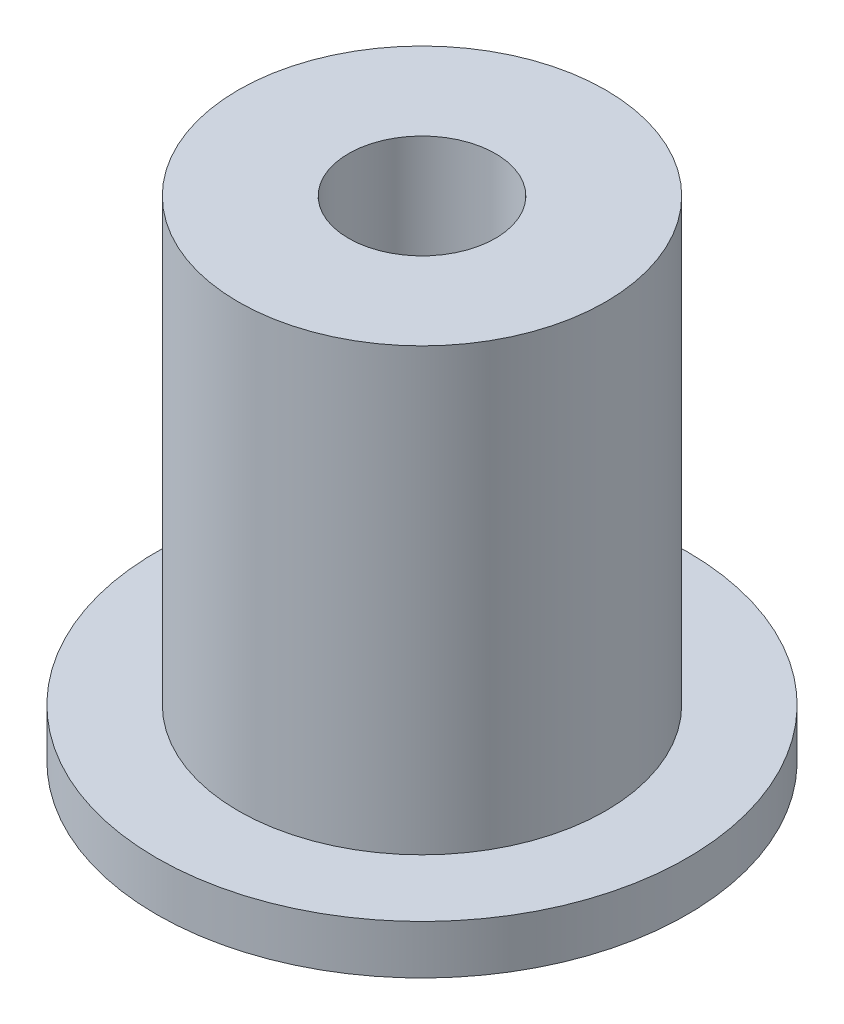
ISO-10303-21;
HEADER;
FILE_DESCRIPTION(('STEP AP214'),'2;1');
FILE_NAME('part.step','',(''),(''),'','','');
FILE_SCHEMA(('AUTOMOTIVE_DESIGN { 1 0 10303 214 1 1 1 1 }'));
ENDSEC;
DATA;
#1=APPLICATION_CONTEXT('core data for automotive mechanical design processes');
#2=APPLICATION_PROTOCOL_DEFINITION('international standard','automotive_design',2000,#1);
#3=PRODUCT_CONTEXT('',#1,'mechanical');
#4=PRODUCT('Part','Part','',(#3));
#5=PRODUCT_RELATED_PRODUCT_CATEGORY('part','',(#4));
#6=PRODUCT_DEFINITION_FORMATION('','',#4);
#7=PRODUCT_DEFINITION_CONTEXT('part definition',#1,'design');
#8=PRODUCT_DEFINITION('design','',#6,#7);
#9=PRODUCT_DEFINITION_SHAPE('','',#8);
#10=(LENGTH_UNIT() NAMED_UNIT(*) SI_UNIT(.MILLI.,.METRE.));
#11=(NAMED_UNIT(*) PLANE_ANGLE_UNIT() SI_UNIT($,.RADIAN.));
#12=(NAMED_UNIT(*) SI_UNIT($,.STERADIAN.) SOLID_ANGLE_UNIT());
#13=UNCERTAINTY_MEASURE_WITH_UNIT(LENGTH_MEASURE(1.E-05),#10,'distance_accuracy_value','');
#14=(GEOMETRIC_REPRESENTATION_CONTEXT(3) GLOBAL_UNCERTAINTY_ASSIGNED_CONTEXT((#13)) GLOBAL_UNIT_ASSIGNED_CONTEXT((#10,
#11,#12)) REPRESENTATION_CONTEXT('',''));
#15=CARTESIAN_POINT('',(0.,0.,0.));
#16=DIRECTION('',(0.,0.,1.));
#17=DIRECTION('',(1.,0.,0.));
#18=AXIS2_PLACEMENT_3D('',#15,#16,#17);
#19=CARTESIAN_POINT('',(0.,6.,0.));
#20=DIRECTION('',(0.,-1.,0.));
#21=DIRECTION('',(0.,0.,-1.));
#22=AXIS2_PLACEMENT_3D('',#19,#20,#21);
#23=CYLINDRICAL_SURFACE('',#22,32.5);
#24=CARTESIAN_POINT('',(0.,6.,0.));
#25=DIRECTION('',(0.,1.,0.));
#26=DIRECTION('',(0.,0.,1.));
#27=AXIS2_PLACEMENT_3D('',#24,#25,#26);
#28=CIRCLE('',#27,32.5);
#29=CARTESIAN_POINT('',(0.,6.,32.5));
#30=VERTEX_POINT('',#29);
#31=EDGE_CURVE('E45',#30,#30,#28,.T.);
#32=ORIENTED_EDGE('',*,*,#31,.F.);
#33=EDGE_LOOP('',(#32));
#34=FACE_BOUND('',#33,.T.);
#35=CARTESIAN_POINT('',(0.,0.,0.));
#36=DIRECTION('',(0.,1.,0.));
#37=DIRECTION('',(0.,0.,1.));
#38=AXIS2_PLACEMENT_3D('',#35,#36,#37);
#39=CIRCLE('',#38,32.5);
#40=CARTESIAN_POINT('',(0.,0.,32.5));
#41=VERTEX_POINT('',#40);
#42=EDGE_CURVE('E40',#41,#41,#39,.T.);
#43=ORIENTED_EDGE('',*,*,#42,.T.);
#44=EDGE_LOOP('',(#43));
#45=FACE_BOUND('',#44,.T.);
#46=ADVANCED_FACE('F37',(#34,#45),#23,.T.);
#47=CARTESIAN_POINT('',(0.,6.,0.));
#48=DIRECTION('',(0.,1.,0.));
#49=DIRECTION('',(0.,0.,1.));
#50=AXIS2_PLACEMENT_3D('',#47,#48,#49);
#51=PLANE('',#50);
#52=CARTESIAN_POINT('',(0.,6.,0.));
#53=DIRECTION('',(0.,1.,0.));
#54=DIRECTION('',(0.,0.,1.));
#55=AXIS2_PLACEMENT_3D('',#52,#53,#54);
#56=CIRCLE('',#55,22.5);
#57=CARTESIAN_POINT('',(0.,6.,22.5));
#58=VERTEX_POINT('',#57);
#59=EDGE_CURVE('E10',#58,#58,#56,.T.);
#60=ORIENTED_EDGE('',*,*,#59,.F.);
#61=EDGE_LOOP('',(#60));
#62=FACE_BOUND('',#61,.T.);
#63=ORIENTED_EDGE('',*,*,#31,.T.);
#64=EDGE_LOOP('',(#63));
#65=FACE_BOUND('',#64,.T.);
#66=ADVANCED_FACE('F81',(#62,#65),#51,.T.);
#67=CARTESIAN_POINT('',(0.,0.,0.));
#68=DIRECTION('',(0.,1.,0.));
#69=DIRECTION('',(0.,0.,1.));
#70=AXIS2_PLACEMENT_3D('',#67,#68,#69);
#71=PLANE('',#70);
#72=CARTESIAN_POINT('',(0.,0.,0.));
#73=DIRECTION('',(0.,1.,0.));
#74=DIRECTION('',(0.,0.,1.));
#75=AXIS2_PLACEMENT_3D('',#72,#73,#74);
#76=CIRCLE('',#75,9.);
#77=CARTESIAN_POINT('',(0.,0.,9.));
#78=VERTEX_POINT('',#77);
#79=EDGE_CURVE('E56',#78,#78,#76,.F.);
#80=ORIENTED_EDGE('',*,*,#79,.F.);
#81=EDGE_LOOP('',(#80));
#82=FACE_BOUND('',#81,.T.);
#83=ORIENTED_EDGE('',*,*,#42,.F.);
#84=EDGE_LOOP('',(#83));
#85=FACE_BOUND('',#84,.T.);
#86=ADVANCED_FACE('F76',(#82,#85),#71,.F.);
#87=CARTESIAN_POINT('',(0.,60.,0.));
#88=DIRECTION('',(0.,-1.,0.));
#89=DIRECTION('',(0.,0.,-1.));
#90=AXIS2_PLACEMENT_3D('',#87,#88,#89);
#91=CYLINDRICAL_SURFACE('',#90,22.5);
#92=CARTESIAN_POINT('',(0.,60.,0.));
#93=DIRECTION('',(0.,1.,0.));
#94=DIRECTION('',(0.,0.,1.));
#95=AXIS2_PLACEMENT_3D('',#92,#93,#94);
#96=CIRCLE('',#95,22.5);
#97=CARTESIAN_POINT('',(0.,60.,22.5));
#98=VERTEX_POINT('',#97);
#99=EDGE_CURVE('E52',#98,#98,#96,.T.);
#100=ORIENTED_EDGE('',*,*,#99,.F.);
#101=EDGE_LOOP('',(#100));
#102=FACE_BOUND('',#101,.T.);
#103=ORIENTED_EDGE('',*,*,#59,.T.);
#104=EDGE_LOOP('',(#103));
#105=FACE_BOUND('',#104,.T.);
#106=ADVANCED_FACE('F71',(#102,#105),#91,.T.);
#107=CARTESIAN_POINT('',(0.,60.,0.));
#108=DIRECTION('',(0.,1.,0.));
#109=DIRECTION('',(0.,0.,1.));
#110=AXIS2_PLACEMENT_3D('',#107,#108,#109);
#111=PLANE('',#110);
#112=CARTESIAN_POINT('',(0.,60.,0.));
#113=DIRECTION('',(0.,1.,0.));
#114=DIRECTION('',(0.,0.,1.));
#115=AXIS2_PLACEMENT_3D('',#112,#113,#114);
#116=CIRCLE('',#115,9.);
#117=CARTESIAN_POINT('',(0.,60.,9.));
#118=VERTEX_POINT('',#117);
#119=EDGE_CURVE('E60',#118,#118,#116,.T.);
#120=ORIENTED_EDGE('',*,*,#119,.F.);
#121=EDGE_LOOP('',(#120));
#122=FACE_BOUND('',#121,.T.);
#123=ORIENTED_EDGE('',*,*,#99,.T.);
#124=EDGE_LOOP('',(#123));
#125=FACE_BOUND('',#124,.T.);
#126=ADVANCED_FACE('F68',(#122,#125),#111,.T.);
#127=CARTESIAN_POINT('',(0.,-0.001000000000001,0.));
#128=DIRECTION('',(0.,1.,0.));
#129=DIRECTION('',(0.,0.,1.));
#130=AXIS2_PLACEMENT_3D('',#127,#128,#129);
#131=CYLINDRICAL_SURFACE('',#130,9.);
#132=ORIENTED_EDGE('',*,*,#119,.T.);
#133=EDGE_LOOP('',(#132));
#134=FACE_BOUND('',#133,.T.);
#135=ORIENTED_EDGE('',*,*,#79,.T.);
#136=EDGE_LOOP('',(#135));
#137=FACE_BOUND('',#136,.T.);
#138=ADVANCED_FACE('F65',(#134,#137),#131,.F.);
#139=CLOSED_SHELL('',(#46,#66,#86,#106,#126,#138));
#140=MANIFOLD_SOLID_BREP('B2',#139);
#141=ADVANCED_BREP_SHAPE_REPRESENTATION('',(#18,#140),#14);
#142=SHAPE_DEFINITION_REPRESENTATION(#9,#141);
ENDSEC;
END-ISO-10303-21;
